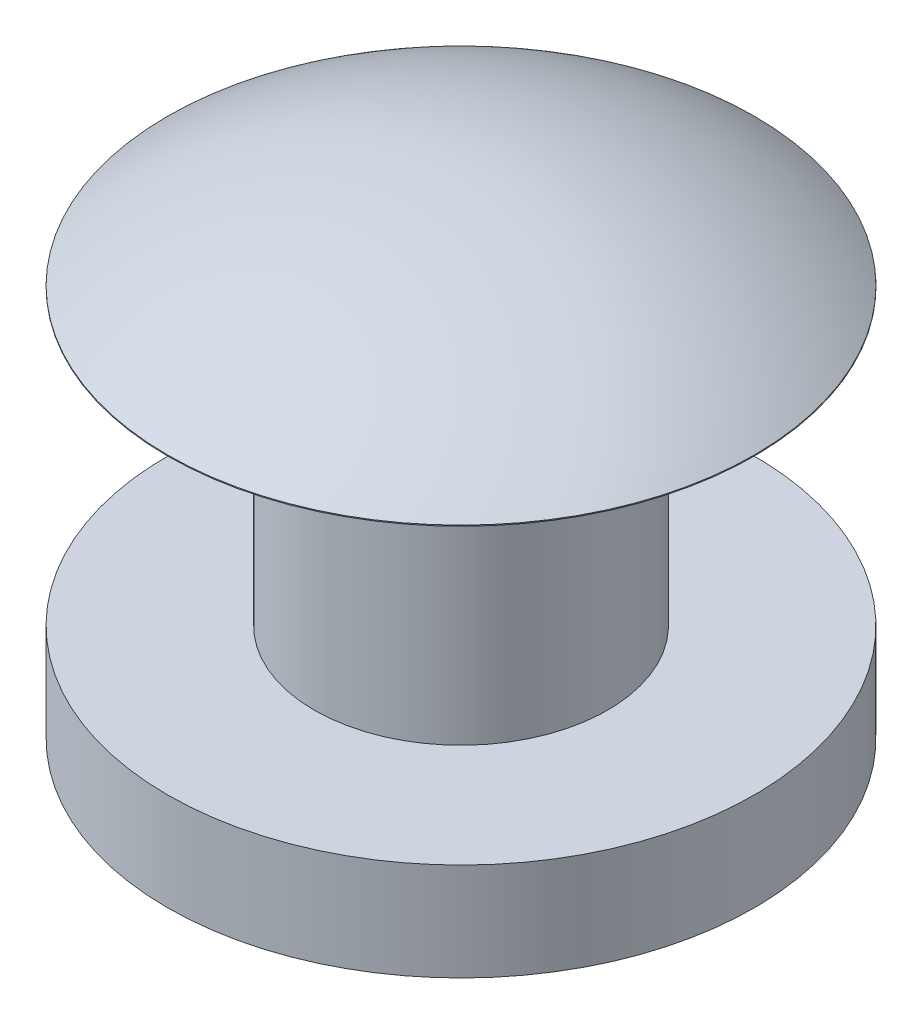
from build123d import *


with BuildPart() as part:
    # Esquisse1 → R_volution1 (revolve)
    with BuildSketch(Plane.XY, mode=Mode.PRIVATE) as r_volution1_sk:
        with BuildLine():
            Line((-1.5, 4), (-1.5, 1))
            Line((-1.5, 1), (-3, 1))
            Line((-3, 1), (-3, 0))
            Line((-3, 0), (0, 0))
            Line((0, 0), (0, 5.008003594))
            ThreePointArc((0, 5.008003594), (-1.580823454, 4.751957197), (-3, 4.01))
            Line((-3, 4.01), (-3, 4))
            Line((-3, 4), (-1.5, 4))
        make_face()
    revolve(r_volution1_sk.sketch.rotate(Axis((0, 12.258894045, 0), (0, -1, 0)), 270), axis=Axis((0, 12.258894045, 0), (0, -1, 0)))


solid = part.part
